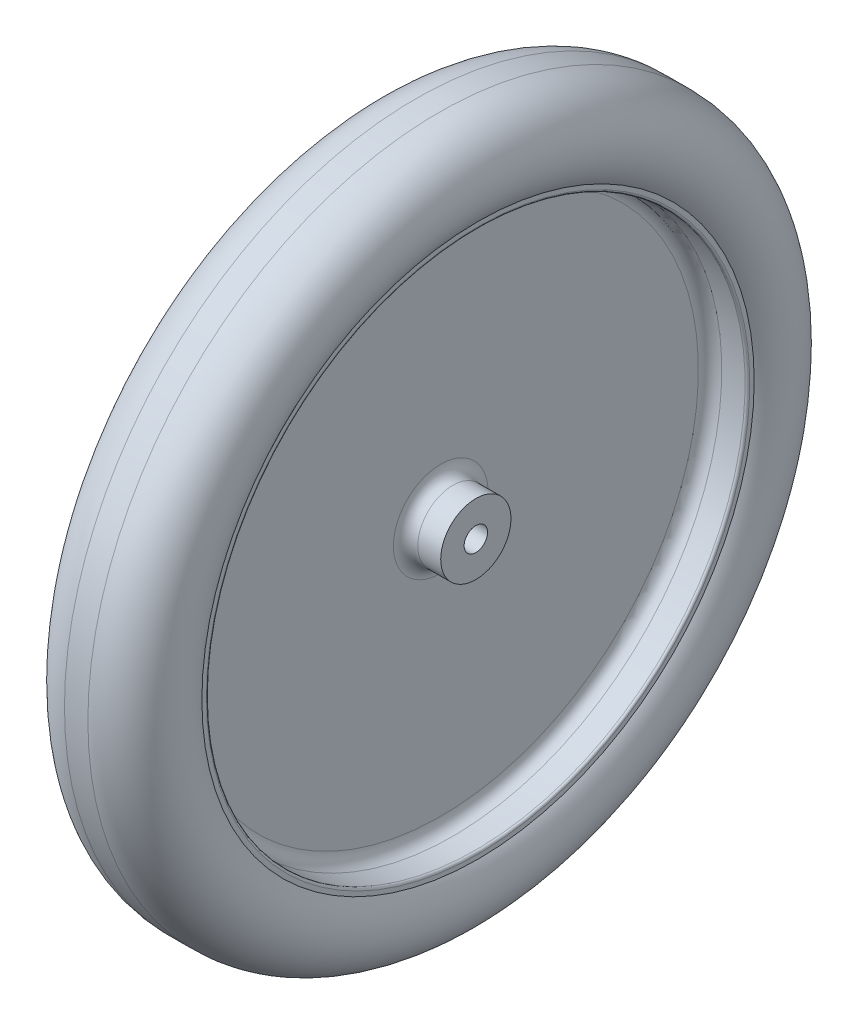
ISO-10303-21;
HEADER;
FILE_DESCRIPTION(('STEP AP214'),'2;1');
FILE_NAME('part.step','',(''),(''),'','','');
FILE_SCHEMA(('AUTOMOTIVE_DESIGN { 1 0 10303 214 1 1 1 1 }'));
ENDSEC;
DATA;
#1=APPLICATION_CONTEXT('core data for automotive mechanical design processes');
#2=APPLICATION_PROTOCOL_DEFINITION('international standard','automotive_design',2000,#1);
#3=PRODUCT_CONTEXT('',#1,'mechanical');
#4=PRODUCT('Part','Part','',(#3));
#5=PRODUCT_RELATED_PRODUCT_CATEGORY('part','',(#4));
#6=PRODUCT_DEFINITION_FORMATION('','',#4);
#7=PRODUCT_DEFINITION_CONTEXT('part definition',#1,'design');
#8=PRODUCT_DEFINITION('design','',#6,#7);
#9=PRODUCT_DEFINITION_SHAPE('','',#8);
#10=(LENGTH_UNIT() NAMED_UNIT(*) SI_UNIT(.MILLI.,.METRE.));
#11=(NAMED_UNIT(*) PLANE_ANGLE_UNIT() SI_UNIT($,.RADIAN.));
#12=(NAMED_UNIT(*) SI_UNIT($,.STERADIAN.) SOLID_ANGLE_UNIT());
#13=UNCERTAINTY_MEASURE_WITH_UNIT(LENGTH_MEASURE(1.E-05),#10,'distance_accuracy_value','');
#14=(GEOMETRIC_REPRESENTATION_CONTEXT(3) GLOBAL_UNCERTAINTY_ASSIGNED_CONTEXT((#13)) GLOBAL_UNIT_ASSIGNED_CONTEXT((#10,
#11,#12)) REPRESENTATION_CONTEXT('',''));
#15=CARTESIAN_POINT('',(0.,0.,0.));
#16=DIRECTION('',(0.,0.,1.));
#17=DIRECTION('',(1.,0.,0.));
#18=AXIS2_PLACEMENT_3D('',#15,#16,#17);
#19=CARTESIAN_POINT('',(21.3562397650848,0.,0.));
#20=DIRECTION('',(-1.,0.,0.));
#21=DIRECTION('',(0.,0.,1.));
#22=AXIS2_PLACEMENT_3D('',#19,#20,#21);
#23=TOROIDAL_SURFACE('',#22,260.022998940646,40.);
#24=CARTESIAN_POINT('',(20.,0.,0.));
#25=DIRECTION('',(-1.,0.,0.));
#26=DIRECTION('',(0.,0.,1.));
#27=AXIS2_PLACEMENT_3D('',#24,#25,#26);
#28=CIRCLE('',#27,300.);
#29=CARTESIAN_POINT('',(20.,0.,300.));
#30=VERTEX_POINT('',#29);
#31=EDGE_CURVE('E96',#30,#30,#28,.T.);
#32=ORIENTED_EDGE('',*,*,#31,.F.);
#33=EDGE_LOOP('',(#32));
#34=FACE_BOUND('',#33,.T.);
#35=CARTESIAN_POINT('',(53.239670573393,0.,0.));
#36=DIRECTION('',(-1.,0.,0.));
#37=DIRECTION('',(0.,0.,1.));
#38=AXIS2_PLACEMENT_3D('',#35,#36,#37);
#39=CIRCLE('',#38,235.868354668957);
#40=CARTESIAN_POINT('',(53.239670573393,0.,235.868354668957));
#41=VERTEX_POINT('',#40);
#42=EDGE_CURVE('E10',#41,#41,#39,.T.);
#43=ORIENTED_EDGE('',*,*,#42,.T.);
#44=EDGE_LOOP('',(#43));
#45=FACE_BOUND('',#44,.T.);
#46=ADVANCED_FACE('F32',(#34,#45),#23,.T.);
#47=CARTESIAN_POINT('',(53.239670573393,232.079406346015,0.));
#48=DIRECTION('',(-1.,0.,0.));
#49=DIRECTION('',(0.,0.,1.));
#50=AXIS2_PLACEMENT_3D('',#47,#48,#49);
#51=PLANE('',#50);
#52=ORIENTED_EDGE('',*,*,#42,.F.);
#53=EDGE_LOOP('',(#52));
#54=FACE_BOUND('',#53,.T.);
#55=CARTESIAN_POINT('',(53.239670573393,0.,0.));
#56=DIRECTION('',(-1.,0.,0.));
#57=DIRECTION('',(0.,0.,1.));
#58=AXIS2_PLACEMENT_3D('',#55,#56,#57);
#59=CIRCLE('',#58,232.079406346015);
#60=CARTESIAN_POINT('',(53.239670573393,0.,232.079406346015));
#61=VERTEX_POINT('',#60);
#62=EDGE_CURVE('E38',#61,#61,#59,.T.);
#63=ORIENTED_EDGE('',*,*,#62,.T.);
#64=EDGE_LOOP('',(#63));
#65=FACE_BOUND('',#64,.T.);
#66=ADVANCED_FACE('F103',(#54,#65),#51,.F.);
#67=CARTESIAN_POINT('',(51.239670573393,0.,0.));
#68=DIRECTION('',(-1.,0.,0.));
#69=DIRECTION('',(0.,0.,1.));
#70=AXIS2_PLACEMENT_3D('',#67,#68,#69);
#71=TOROIDAL_SURFACE('',#70,232.079406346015,2.);
#72=ORIENTED_EDGE('',*,*,#62,.F.);
#73=EDGE_LOOP('',(#72));
#74=FACE_BOUND('',#73,.T.);
#75=CARTESIAN_POINT('',(51.239670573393,0.,0.));
#76=DIRECTION('',(-1.,0.,0.));
#77=DIRECTION('',(0.,0.,1.));
#78=AXIS2_PLACEMENT_3D('',#75,#76,#77);
#79=CIRCLE('',#78,230.079406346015);
#80=CARTESIAN_POINT('',(51.239670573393,0.,230.079406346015));
#81=VERTEX_POINT('',#80);
#82=EDGE_CURVE('E42',#81,#81,#79,.T.);
#83=ORIENTED_EDGE('',*,*,#82,.T.);
#84=EDGE_LOOP('',(#83));
#85=FACE_BOUND('',#84,.T.);
#86=ADVANCED_FACE('F107',(#74,#85),#71,.T.);
#87=CARTESIAN_POINT('',(-36.2684599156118,0.,0.));
#88=DIRECTION('',(-1.,0.,0.));
#89=DIRECTION('',(0.,0.,1.));
#90=AXIS2_PLACEMENT_3D('',#87,#88,#89);
#91=CYLINDRICAL_SURFACE('',#90,230.079406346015);
#92=ORIENTED_EDGE('',*,*,#82,.F.);
#93=EDGE_LOOP('',(#92));
#94=FACE_BOUND('',#93,.T.);
#95=CARTESIAN_POINT('',(31.3562397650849,0.,0.));
#96=DIRECTION('',(-1.,0.,0.));
#97=DIRECTION('',(0.,0.,1.));
#98=AXIS2_PLACEMENT_3D('',#95,#96,#97);
#99=CIRCLE('',#98,230.079406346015);
#100=CARTESIAN_POINT('',(31.3562397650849,0.,230.079406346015));
#101=VERTEX_POINT('',#100);
#102=EDGE_CURVE('E46',#101,#101,#99,.T.);
#103=ORIENTED_EDGE('',*,*,#102,.T.);
#104=EDGE_LOOP('',(#103));
#105=FACE_BOUND('',#104,.T.);
#106=ADVANCED_FACE('F112',(#94,#105),#91,.F.);
#107=CARTESIAN_POINT('',(31.3562397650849,0.,0.));
#108=DIRECTION('',(-1.,0.,0.));
#109=DIRECTION('',(0.,0.,1.));
#110=AXIS2_PLACEMENT_3D('',#107,#108,#109);
#111=TOROIDAL_SURFACE('',#110,220.079406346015,10.);
#112=ORIENTED_EDGE('',*,*,#102,.F.);
#113=EDGE_LOOP('',(#112));
#114=FACE_BOUND('',#113,.T.);
#115=CARTESIAN_POINT('',(21.3562397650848,0.,0.));
#116=DIRECTION('',(-1.,0.,0.));
#117=DIRECTION('',(0.,0.,1.));
#118=AXIS2_PLACEMENT_3D('',#115,#116,#117);
#119=CIRCLE('',#118,220.079406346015);
#120=CARTESIAN_POINT('',(21.3562397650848,0.,220.079406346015));
#121=VERTEX_POINT('',#120);
#122=EDGE_CURVE('E51',#121,#121,#119,.T.);
#123=ORIENTED_EDGE('',*,*,#122,.T.);
#124=EDGE_LOOP('',(#123));
#125=FACE_BOUND('',#124,.T.);
#126=ADVANCED_FACE('F118',(#114,#125),#111,.F.);
#127=CARTESIAN_POINT('',(21.3562397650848,40.4006315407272,0.));
#128=DIRECTION('',(-1.,0.,0.));
#129=DIRECTION('',(0.,0.,1.));
#130=AXIS2_PLACEMENT_3D('',#127,#128,#129);
#131=PLANE('',#130);
#132=ORIENTED_EDGE('',*,*,#122,.F.);
#133=EDGE_LOOP('',(#132));
#134=FACE_BOUND('',#133,.T.);
#135=CARTESIAN_POINT('',(21.3562397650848,0.,0.));
#136=DIRECTION('',(-1.,0.,0.));
#137=DIRECTION('',(0.,0.,1.));
#138=AXIS2_PLACEMENT_3D('',#135,#136,#137);
#139=CIRCLE('',#138,40.4006315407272);
#140=CARTESIAN_POINT('',(21.3562397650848,0.,40.4006315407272));
#141=VERTEX_POINT('',#140);
#142=EDGE_CURVE('E54',#141,#141,#139,.T.);
#143=ORIENTED_EDGE('',*,*,#142,.T.);
#144=EDGE_LOOP('',(#143));
#145=FACE_BOUND('',#144,.T.);
#146=ADVANCED_FACE('F122',(#134,#145),#131,.F.);
#147=CARTESIAN_POINT('',(31.756871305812,0.,0.));
#148=DIRECTION('',(-1.,0.,0.));
#149=DIRECTION('',(0.,0.,1.));
#150=AXIS2_PLACEMENT_3D('',#147,#148,#149);
#151=TOROIDAL_SURFACE('',#150,40.4006315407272,10.4006315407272);
#152=ORIENTED_EDGE('',*,*,#142,.F.);
#153=EDGE_LOOP('',(#152));
#154=FACE_BOUND('',#153,.T.);
#155=CARTESIAN_POINT('',(31.756871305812,0.,0.));
#156=DIRECTION('',(-1.,0.,0.));
#157=DIRECTION('',(0.,0.,1.));
#158=AXIS2_PLACEMENT_3D('',#155,#156,#157);
#159=CIRCLE('',#158,30.);
#160=CARTESIAN_POINT('',(31.756871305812,0.,30.));
#161=VERTEX_POINT('',#160);
#162=EDGE_CURVE('E57',#161,#161,#159,.T.);
#163=ORIENTED_EDGE('',*,*,#162,.T.);
#164=EDGE_LOOP('',(#163));
#165=FACE_BOUND('',#164,.T.);
#166=ADVANCED_FACE('F126',(#154,#165),#151,.F.);
#167=CARTESIAN_POINT('',(-36.2684599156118,0.,0.));
#168=DIRECTION('',(-1.,0.,0.));
#169=DIRECTION('',(0.,0.,1.));
#170=AXIS2_PLACEMENT_3D('',#167,#168,#169);
#171=CYLINDRICAL_SURFACE('',#170,30.);
#172=ORIENTED_EDGE('',*,*,#162,.F.);
#173=EDGE_LOOP('',(#172));
#174=FACE_BOUND('',#173,.T.);
#175=CARTESIAN_POINT('',(51.3562397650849,0.,0.));
#176=DIRECTION('',(-1.,0.,0.));
#177=DIRECTION('',(0.,0.,1.));
#178=AXIS2_PLACEMENT_3D('',#175,#176,#177);
#179=CIRCLE('',#178,30.);
#180=CARTESIAN_POINT('',(51.3562397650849,0.,30.));
#181=VERTEX_POINT('',#180);
#182=EDGE_CURVE('E60',#181,#181,#179,.T.);
#183=ORIENTED_EDGE('',*,*,#182,.T.);
#184=EDGE_LOOP('',(#183));
#185=FACE_BOUND('',#184,.T.);
#186=ADVANCED_FACE('F130',(#174,#185),#171,.T.);
#187=CARTESIAN_POINT('',(51.3562397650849,9.99999999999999,0.));
#188=DIRECTION('',(-1.,0.,0.));
#189=DIRECTION('',(0.,0.,1.));
#190=AXIS2_PLACEMENT_3D('',#187,#188,#189);
#191=PLANE('',#190);
#192=ORIENTED_EDGE('',*,*,#182,.F.);
#193=EDGE_LOOP('',(#192));
#194=FACE_BOUND('',#193,.T.);
#195=CARTESIAN_POINT('',(51.3562397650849,0.,0.));
#196=DIRECTION('',(-1.,0.,0.));
#197=DIRECTION('',(0.,0.,1.));
#198=AXIS2_PLACEMENT_3D('',#195,#196,#197);
#199=CIRCLE('',#198,9.99999999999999);
#200=CARTESIAN_POINT('',(51.3562397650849,0.,9.99999999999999));
#201=VERTEX_POINT('',#200);
#202=EDGE_CURVE('E63',#201,#201,#199,.T.);
#203=ORIENTED_EDGE('',*,*,#202,.T.);
#204=EDGE_LOOP('',(#203));
#205=FACE_BOUND('',#204,.T.);
#206=ADVANCED_FACE('F134',(#194,#205),#191,.F.);
#207=CARTESIAN_POINT('',(-36.2684599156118,0.,0.));
#208=DIRECTION('',(-1.,0.,0.));
#209=DIRECTION('',(0.,0.,1.));
#210=AXIS2_PLACEMENT_3D('',#207,#208,#209);
#211=CYLINDRICAL_SURFACE('',#210,9.99999999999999);
#212=ORIENTED_EDGE('',*,*,#202,.F.);
#213=EDGE_LOOP('',(#212));
#214=FACE_BOUND('',#213,.T.);
#215=CARTESIAN_POINT('',(-28.6437602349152,0.,0.));
#216=DIRECTION('',(-1.,0.,0.));
#217=DIRECTION('',(0.,0.,1.));
#218=AXIS2_PLACEMENT_3D('',#215,#216,#217);
#219=CIRCLE('',#218,9.99999999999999);
#220=CARTESIAN_POINT('',(-28.6437602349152,0.,9.99999999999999));
#221=VERTEX_POINT('',#220);
#222=EDGE_CURVE('E66',#221,#221,#219,.T.);
#223=ORIENTED_EDGE('',*,*,#222,.T.);
#224=EDGE_LOOP('',(#223));
#225=FACE_BOUND('',#224,.T.);
#226=ADVANCED_FACE('F138',(#214,#225),#211,.F.);
#227=CARTESIAN_POINT('',(-28.6437602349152,9.99999999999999,0.));
#228=DIRECTION('',(1.,0.,0.));
#229=DIRECTION('',(0.,0.,-1.));
#230=AXIS2_PLACEMENT_3D('',#227,#228,#229);
#231=PLANE('',#230);
#232=ORIENTED_EDGE('',*,*,#222,.F.);
#233=EDGE_LOOP('',(#232));
#234=FACE_BOUND('',#233,.T.);
#235=CARTESIAN_POINT('',(-28.6437602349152,0.,0.));
#236=DIRECTION('',(-1.,0.,0.));
#237=DIRECTION('',(0.,0.,1.));
#238=AXIS2_PLACEMENT_3D('',#235,#236,#237);
#239=CIRCLE('',#238,30.);
#240=CARTESIAN_POINT('',(-28.6437602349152,0.,30.));
#241=VERTEX_POINT('',#240);
#242=EDGE_CURVE('E69',#241,#241,#239,.T.);
#243=ORIENTED_EDGE('',*,*,#242,.T.);
#244=EDGE_LOOP('',(#243));
#245=FACE_BOUND('',#244,.T.);
#246=ADVANCED_FACE('F142',(#234,#245),#231,.F.);
#247=CARTESIAN_POINT('',(-36.2684599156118,0.,0.));
#248=DIRECTION('',(-1.,0.,0.));
#249=DIRECTION('',(0.,0.,1.));
#250=AXIS2_PLACEMENT_3D('',#247,#248,#249);
#251=CYLINDRICAL_SURFACE('',#250,30.);
#252=ORIENTED_EDGE('',*,*,#242,.F.);
#253=EDGE_LOOP('',(#252));
#254=FACE_BOUND('',#253,.T.);
#255=CARTESIAN_POINT('',(-9.95466591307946,0.,0.));
#256=DIRECTION('',(-1.,0.,0.));
#257=DIRECTION('',(0.,0.,1.));
#258=AXIS2_PLACEMENT_3D('',#255,#256,#257);
#259=CIRCLE('',#258,30.);
#260=CARTESIAN_POINT('',(-9.95466591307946,0.,30.));
#261=VERTEX_POINT('',#260);
#262=EDGE_CURVE('E72',#261,#261,#259,.T.);
#263=ORIENTED_EDGE('',*,*,#262,.T.);
#264=EDGE_LOOP('',(#263));
#265=FACE_BOUND('',#264,.T.);
#266=ADVANCED_FACE('F146',(#254,#265),#251,.T.);
#267=CARTESIAN_POINT('',(-9.95466591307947,0.,0.));
#268=DIRECTION('',(-1.,0.,0.));
#269=DIRECTION('',(0.,0.,1.));
#270=AXIS2_PLACEMENT_3D('',#267,#268,#269);
#271=TOROIDAL_SURFACE('',#270,41.3109056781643,11.3109056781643);
#272=ORIENTED_EDGE('',*,*,#262,.F.);
#273=EDGE_LOOP('',(#272));
#274=FACE_BOUND('',#273,.T.);
#275=CARTESIAN_POINT('',(1.35623976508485,0.,0.));
#276=DIRECTION('',(-1.,0.,0.));
#277=DIRECTION('',(0.,0.,1.));
#278=AXIS2_PLACEMENT_3D('',#275,#276,#277);
#279=CIRCLE('',#278,41.3109056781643);
#280=CARTESIAN_POINT('',(1.35623976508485,0.,41.3109056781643));
#281=VERTEX_POINT('',#280);
#282=EDGE_CURVE('E75',#281,#281,#279,.T.);
#283=ORIENTED_EDGE('',*,*,#282,.T.);
#284=EDGE_LOOP('',(#283));
#285=FACE_BOUND('',#284,.T.);
#286=ADVANCED_FACE('F150',(#274,#285),#271,.F.);
#287=CARTESIAN_POINT('',(1.35623976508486,41.3109056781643,0.));
#288=DIRECTION('',(1.,0.,0.));
#289=DIRECTION('',(0.,0.,-1.));
#290=AXIS2_PLACEMENT_3D('',#287,#288,#289);
#291=PLANE('',#290);
#292=ORIENTED_EDGE('',*,*,#282,.F.);
#293=EDGE_LOOP('',(#292));
#294=FACE_BOUND('',#293,.T.);
#295=CARTESIAN_POINT('',(1.35623976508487,0.,0.));
#296=DIRECTION('',(-1.,0.,0.));
#297=DIRECTION('',(0.,0.,1.));
#298=AXIS2_PLACEMENT_3D('',#295,#296,#297);
#299=CIRCLE('',#298,220.079406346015);
#300=CARTESIAN_POINT('',(1.35623976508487,0.,220.079406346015));
#301=VERTEX_POINT('',#300);
#302=EDGE_CURVE('E78',#301,#301,#299,.T.);
#303=ORIENTED_EDGE('',*,*,#302,.T.);
#304=EDGE_LOOP('',(#303));
#305=FACE_BOUND('',#304,.T.);
#306=ADVANCED_FACE('F154',(#294,#305),#291,.F.);
#307=CARTESIAN_POINT('',(-8.64376023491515,0.,0.));
#308=DIRECTION('',(-1.,0.,0.));
#309=DIRECTION('',(0.,0.,1.));
#310=AXIS2_PLACEMENT_3D('',#307,#308,#309);
#311=TOROIDAL_SURFACE('',#310,220.079406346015,10.);
#312=ORIENTED_EDGE('',*,*,#302,.F.);
#313=EDGE_LOOP('',(#312));
#314=FACE_BOUND('',#313,.T.);
#315=CARTESIAN_POINT('',(-8.64376023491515,0.,0.));
#316=DIRECTION('',(-1.,0.,0.));
#317=DIRECTION('',(0.,0.,1.));
#318=AXIS2_PLACEMENT_3D('',#315,#316,#317);
#319=CIRCLE('',#318,230.079406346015);
#320=CARTESIAN_POINT('',(-8.64376023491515,0.,230.079406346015));
#321=VERTEX_POINT('',#320);
#322=EDGE_CURVE('E81',#321,#321,#319,.T.);
#323=ORIENTED_EDGE('',*,*,#322,.T.);
#324=EDGE_LOOP('',(#323));
#325=FACE_BOUND('',#324,.T.);
#326=ADVANCED_FACE('F158',(#314,#325),#311,.F.);
#327=CARTESIAN_POINT('',(-36.2684599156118,0.,0.));
#328=DIRECTION('',(-1.,0.,0.));
#329=DIRECTION('',(0.,0.,1.));
#330=AXIS2_PLACEMENT_3D('',#327,#328,#329);
#331=CYLINDRICAL_SURFACE('',#330,230.079406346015);
#332=ORIENTED_EDGE('',*,*,#322,.F.);
#333=EDGE_LOOP('',(#332));
#334=FACE_BOUND('',#333,.T.);
#335=CARTESIAN_POINT('',(-28.8425175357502,0.,0.));
#336=DIRECTION('',(-1.,0.,0.));
#337=DIRECTION('',(0.,0.,1.));
#338=AXIS2_PLACEMENT_3D('',#335,#336,#337);
#339=CIRCLE('',#338,230.079406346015);
#340=CARTESIAN_POINT('',(-28.8425175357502,0.,230.079406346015));
#341=VERTEX_POINT('',#340);
#342=EDGE_CURVE('E84',#341,#341,#339,.T.);
#343=ORIENTED_EDGE('',*,*,#342,.T.);
#344=EDGE_LOOP('',(#343));
#345=FACE_BOUND('',#344,.T.);
#346=ADVANCED_FACE('F162',(#334,#345),#331,.F.);
#347=CARTESIAN_POINT('',(-28.8425175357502,0.,0.));
#348=DIRECTION('',(-1.,0.,0.));
#349=DIRECTION('',(0.,0.,1.));
#350=AXIS2_PLACEMENT_3D('',#347,#348,#349);
#351=TOROIDAL_SURFACE('',#350,232.079406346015,1.99999999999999);
#352=ORIENTED_EDGE('',*,*,#342,.F.);
#353=EDGE_LOOP('',(#352));
#354=FACE_BOUND('',#353,.T.);
#355=CARTESIAN_POINT('',(-30.8425175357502,0.,0.));
#356=DIRECTION('',(-1.,0.,0.));
#357=DIRECTION('',(0.,0.,1.));
#358=AXIS2_PLACEMENT_3D('',#355,#356,#357);
#359=CIRCLE('',#358,232.079406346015);
#360=CARTESIAN_POINT('',(-30.8425175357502,0.,232.079406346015));
#361=VERTEX_POINT('',#360);
#362=EDGE_CURVE('E87',#361,#361,#359,.T.);
#363=ORIENTED_EDGE('',*,*,#362,.T.);
#364=EDGE_LOOP('',(#363));
#365=FACE_BOUND('',#364,.T.);
#366=ADVANCED_FACE('F166',(#354,#365),#351,.T.);
#367=CARTESIAN_POINT('',(-30.8425175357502,232.079406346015,0.));
#368=DIRECTION('',(1.,0.,0.));
#369=DIRECTION('',(0.,0.,-1.));
#370=AXIS2_PLACEMENT_3D('',#367,#368,#369);
#371=PLANE('',#370);
#372=ORIENTED_EDGE('',*,*,#362,.F.);
#373=EDGE_LOOP('',(#372));
#374=FACE_BOUND('',#373,.T.);
#375=CARTESIAN_POINT('',(-30.8425175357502,0.,0.));
#376=DIRECTION('',(-1.,0.,0.));
#377=DIRECTION('',(0.,0.,1.));
#378=AXIS2_PLACEMENT_3D('',#375,#376,#377);
#379=CIRCLE('',#378,236.290320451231);
#380=CARTESIAN_POINT('',(-30.8425175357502,0.,236.290320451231));
#381=VERTEX_POINT('',#380);
#382=EDGE_CURVE('E90',#381,#381,#379,.T.);
#383=ORIENTED_EDGE('',*,*,#382,.T.);
#384=EDGE_LOOP('',(#383));
#385=FACE_BOUND('',#384,.T.);
#386=ADVANCED_FACE('F170',(#374,#385),#371,.F.);
#387=CARTESIAN_POINT('',(1.35623976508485,0.,0.));
#388=DIRECTION('',(-1.,0.,0.));
#389=DIRECTION('',(0.,0.,1.));
#390=AXIS2_PLACEMENT_3D('',#387,#388,#389);
#391=TOROIDAL_SURFACE('',#390,260.022998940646,40.);
#392=ORIENTED_EDGE('',*,*,#382,.F.);
#393=EDGE_LOOP('',(#392));
#394=FACE_BOUND('',#393,.T.);
#395=CARTESIAN_POINT('',(0.,0.,0.));
#396=DIRECTION('',(-1.,0.,0.));
#397=DIRECTION('',(0.,0.,1.));
#398=AXIS2_PLACEMENT_3D('',#395,#396,#397);
#399=CIRCLE('',#398,300.);
#400=CARTESIAN_POINT('',(0.,0.,300.));
#401=VERTEX_POINT('',#400);
#402=EDGE_CURVE('E93',#401,#401,#399,.T.);
#403=ORIENTED_EDGE('',*,*,#402,.T.);
#404=EDGE_LOOP('',(#403));
#405=FACE_BOUND('',#404,.T.);
#406=ADVANCED_FACE('F174',(#394,#405),#391,.T.);
#407=CARTESIAN_POINT('',(-36.2684599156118,0.,0.));
#408=DIRECTION('',(-1.,0.,0.));
#409=DIRECTION('',(0.,0.,1.));
#410=AXIS2_PLACEMENT_3D('',#407,#408,#409);
#411=CYLINDRICAL_SURFACE('',#410,300.);
#412=ORIENTED_EDGE('',*,*,#402,.F.);
#413=EDGE_LOOP('',(#412));
#414=FACE_BOUND('',#413,.T.);
#415=ORIENTED_EDGE('',*,*,#31,.T.);
#416=EDGE_LOOP('',(#415));
#417=FACE_BOUND('',#416,.T.);
#418=ADVANCED_FACE('F100',(#414,#417),#411,.T.);
#419=CLOSED_SHELL('',(#46,#66,#86,#106,#126,#146,#166,#186,#206,#226,#246,#266,#286,#306,#326,
#346,#366,#386,#406,#418));
#420=MANIFOLD_SOLID_BREP('B2',#419);
#421=ADVANCED_BREP_SHAPE_REPRESENTATION('',(#18,#420),#14);
#422=SHAPE_DEFINITION_REPRESENTATION(#9,#421);
ENDSEC;
END-ISO-10303-21;
